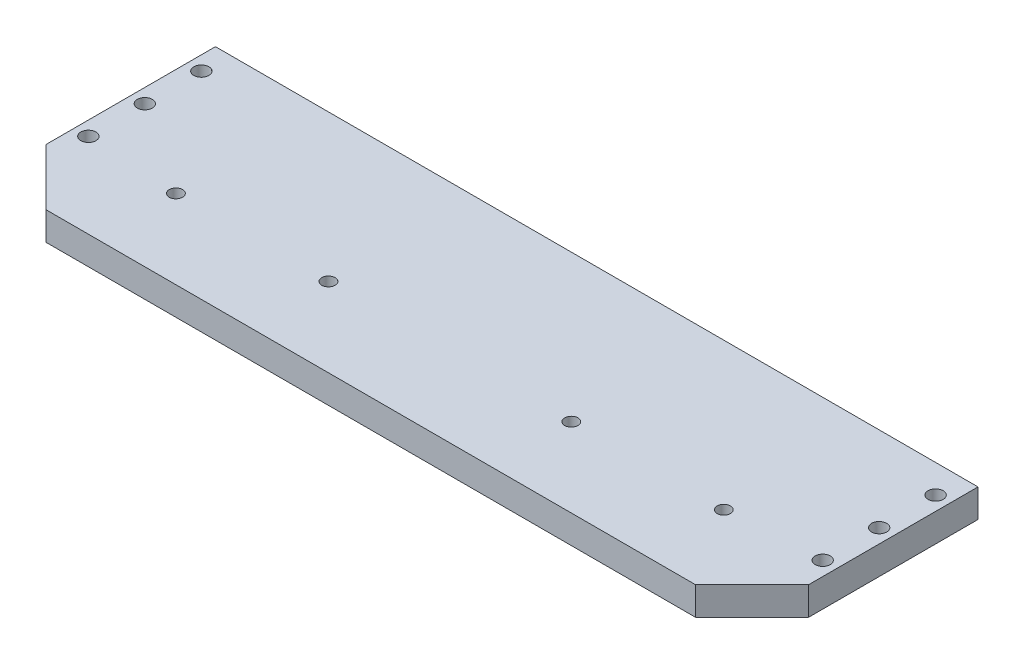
from build123d import *

# Parameters (mm, degrees)
SKETCH1_W           = 171.45
SKETCH1_H           = 6.35
BOSS_EXTRUDE1_DEPTH = 50.8
CHAMFER1_SIZE       = 12.7
SKETCH3_R           = 1.5
CUT_EXTRUDE2_DEPTH  = 211.30165291
SKETCH4_R           = 1.7
CUT_EXTRUDE3_DEPTH  = 211.30165291


with BuildPart() as part:
    # Sketch1 → Boss-Extrude1 (new body)
    with BuildSketch(Plane.XY):
        with Locations((-118.250054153, 276.225)):
            Rectangle(SKETCH1_W, SKETCH1_H)
    extrude(amount=BOSS_EXTRUDE1_DEPTH)

    # Chamfer1
    chamfer1_edges = [part.edges().sort_by_distance(p)[0] for p in [
        (-203.975054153, 276.225, 50.8),
        (-32.525054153, 276.225, 50.8),
    ]]
    chamfer(chamfer1_edges, length=CHAMFER1_SIZE)

    # Sketch3 → Cut-Extrude2 (cut, through all)
    with BuildSketch(Plane(origin=(0, 279.4, 0), x_dir=(1, 0, 0), z_dir=(0, 1, 0))):
        with Locations(Location((-90.945054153, -33.02, 0), (0, 0, 270))):
            Circle(SKETCH3_R)
        with Locations(Location((-56.655054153, -33.02, 0), (0, 0, 270))):
            Circle(SKETCH3_R)
        with Locations(Location((-145.555054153, -33.02, 0), (0, 0, 270))):
            Circle(SKETCH3_R)
        with Locations(Location((-179.845054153, -33.02, 0), (0, 0, 270))):
            Circle(SKETCH3_R)
    extrude(amount=-CUT_EXTRUDE2_DEPTH, mode=Mode.SUBTRACT)

    # Sketch4 → Cut-Extrude3 (cut, through all)
    with BuildSketch(Plane(origin=(0, 279.4, 0), x_dir=(1, 0, 0), z_dir=(0, 1, 0))):
        with Locations(Location((-200.800054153, -6.35, 0), (0, 0, 270))):
            Circle(SKETCH4_R)
        with Locations(Location((-200.800054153, -19.05, 0), (0, 0, 270))):
            Circle(SKETCH4_R)
        with Locations(Location((-200.800054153, -31.75, 0), (0, 0, 270))):
            Circle(SKETCH4_R)
        with Locations(Location((-35.700054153, -31.75, 0), (0, 0, 270))):
            Circle(SKETCH4_R)
        with Locations(Location((-35.700054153, -19.05, 0), (0, 0, 270))):
            Circle(SKETCH4_R)
        with Locations(Location((-35.700054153, -6.35, 0), (0, 0, 270))):
            Circle(SKETCH4_R)
    extrude(amount=-CUT_EXTRUDE3_DEPTH, mode=Mode.SUBTRACT)


solid = part.part
